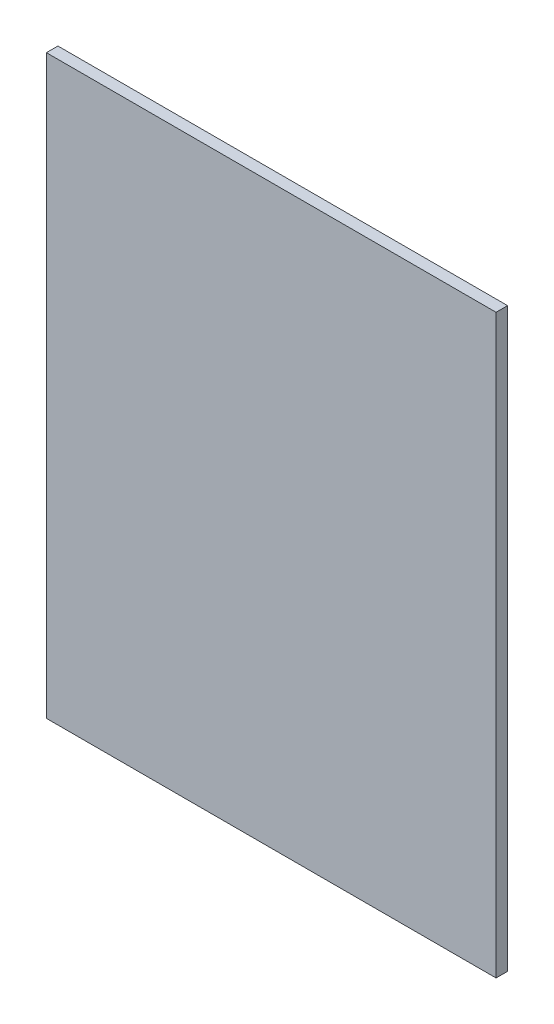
from build123d import *

# Parameters (mm, degrees)
CROQUIS1_W              = 390
CROQUIS1_H              = 500
SALIENTE_EXTRUIR1_DEPTH = 10


with BuildPart() as part:
    # Croquis1 → Saliente-Extruir1 (new body)
    with BuildSketch(Plane.XY):
        with Locations((-195, 250)):
            Rectangle(CROQUIS1_W, CROQUIS1_H)
    extrude(amount=-SALIENTE_EXTRUIR1_DEPTH)


solid = part.part
